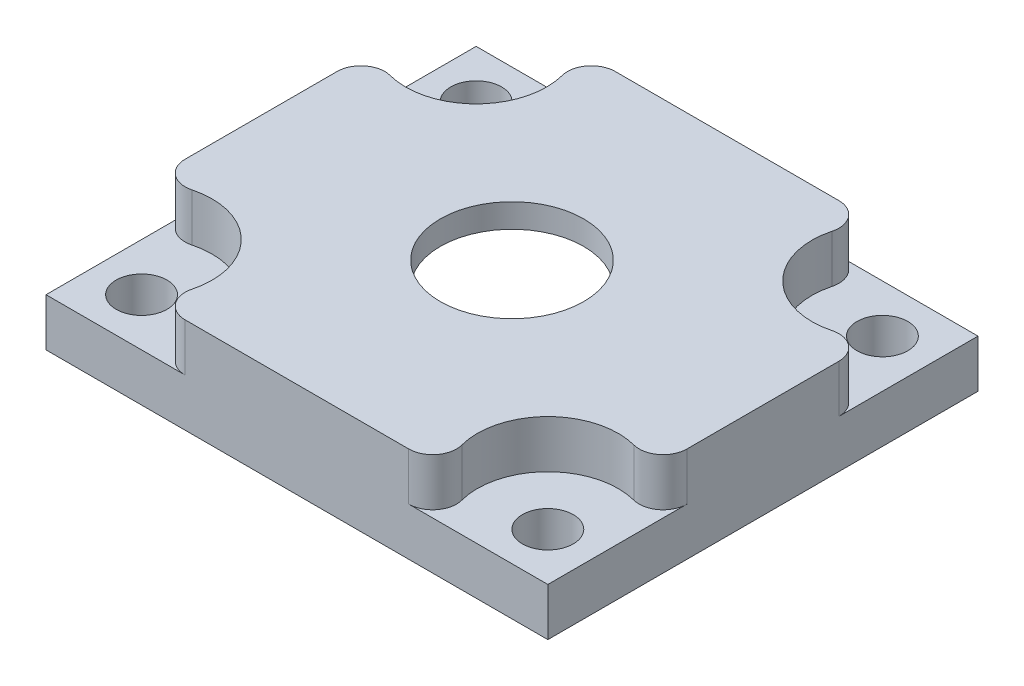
ISO-10303-21;
HEADER;
FILE_DESCRIPTION(('STEP AP214'),'2;1');
FILE_NAME('part.step','',(''),(''),'','','');
FILE_SCHEMA(('AUTOMOTIVE_DESIGN { 1 0 10303 214 1 1 1 1 }'));
ENDSEC;
DATA;
#1=APPLICATION_CONTEXT('core data for automotive mechanical design processes');
#2=APPLICATION_PROTOCOL_DEFINITION('international standard','automotive_design',2000,#1);
#3=PRODUCT_CONTEXT('',#1,'mechanical');
#4=PRODUCT('Part','Part','',(#3));
#5=PRODUCT_RELATED_PRODUCT_CATEGORY('part','',(#4));
#6=PRODUCT_DEFINITION_FORMATION('','',#4);
#7=PRODUCT_DEFINITION_CONTEXT('part definition',#1,'design');
#8=PRODUCT_DEFINITION('design','',#6,#7);
#9=PRODUCT_DEFINITION_SHAPE('','',#8);
#10=(LENGTH_UNIT() NAMED_UNIT(*) SI_UNIT(.MILLI.,.METRE.));
#11=(NAMED_UNIT(*) PLANE_ANGLE_UNIT() SI_UNIT($,.RADIAN.));
#12=(NAMED_UNIT(*) SI_UNIT($,.STERADIAN.) SOLID_ANGLE_UNIT());
#13=UNCERTAINTY_MEASURE_WITH_UNIT(LENGTH_MEASURE(1.E-05),#10,'distance_accuracy_value','');
#14=(GEOMETRIC_REPRESENTATION_CONTEXT(3) GLOBAL_UNCERTAINTY_ASSIGNED_CONTEXT((#13)) GLOBAL_UNIT_ASSIGNED_CONTEXT((#10,
#11,#12)) REPRESENTATION_CONTEXT('',''));
#15=CARTESIAN_POINT('',(0.,0.,0.));
#16=DIRECTION('',(0.,0.,1.));
#17=DIRECTION('',(1.,0.,0.));
#18=AXIS2_PLACEMENT_3D('',#15,#16,#17);
#19=CARTESIAN_POINT('',(0.,12.7,0.));
#20=DIRECTION('',(0.,-1.,0.));
#21=DIRECTION('',(0.,0.,-1.));
#22=AXIS2_PLACEMENT_3D('',#19,#20,#21);
#23=PLANE('',#22);
#24=CARTESIAN_POINT('',(0.,12.7,0.));
#25=DIRECTION('',(0.,1.,0.));
#26=DIRECTION('',(0.,0.,1.));
#27=AXIS2_PLACEMENT_3D('',#24,#25,#26);
#28=CIRCLE('',#27,9.525);
#29=CARTESIAN_POINT('',(0.,12.7,9.525));
#30=VERTEX_POINT('',#29);
#31=EDGE_CURVE('E815',#30,#30,#28,.T.);
#32=ORIENTED_EDGE('',*,*,#31,.F.);
#33=EDGE_LOOP('',(#32));
#34=FACE_BOUND('',#33,.T.);
#35=DIRECTION('',(-1.,0.,0.));
#36=VECTOR('',#35,1.);
#37=CARTESIAN_POINT('',(-33.3375,12.7,-28.575));
#38=LINE('',#37,#36);
#39=CARTESIAN_POINT('',(14.8548034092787,12.7,-28.575));
#40=VERTEX_POINT('',#39);
#41=CARTESIAN_POINT('',(-14.8548034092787,12.7,-28.575));
#42=VERTEX_POINT('',#41);
#43=EDGE_CURVE('E470',#40,#42,#38,.T.);
#44=ORIENTED_EDGE('',*,*,#43,.T.);
#45=CARTESIAN_POINT('',(-14.8548034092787,12.7,-25.4));
#46=DIRECTION('',(0.,-1.,0.));
#47=DIRECTION('',(0.,0.,-1.));
#48=AXIS2_PLACEMENT_3D('',#45,#46,#47);
#49=CIRCLE('',#48,3.175);
#50=CARTESIAN_POINT('',(-17.9263721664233,12.7,-24.5962025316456));
#51=VERTEX_POINT('',#50);
#52=EDGE_CURVE('E529',#42,#51,#49,.F.);
#53=ORIENTED_EDGE('',*,*,#52,.T.);
#54=CARTESIAN_POINT('',(-26.9875,12.7,-22.225));
#55=DIRECTION('',(0.,1.,0.));
#56=DIRECTION('',(0.,0.,1.));
#57=AXIS2_PLACEMENT_3D('',#54,#55,#56);
#58=CIRCLE('',#57,9.36625);
#59=CARTESIAN_POINT('',(-29.3587025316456,12.7,-13.1638721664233));
#60=VERTEX_POINT('',#59);
#61=EDGE_CURVE('E411',#60,#51,#58,.T.);
#62=ORIENTED_EDGE('',*,*,#61,.F.);
#63=CARTESIAN_POINT('',(-30.1625,12.7,-10.0923034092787));
#64=DIRECTION('',(0.,-1.,0.));
#65=DIRECTION('',(0.,0.,-1.));
#66=AXIS2_PLACEMENT_3D('',#63,#64,#65);
#67=CIRCLE('',#66,3.175);
#68=CARTESIAN_POINT('',(-33.3375,12.7,-10.0923034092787));
#69=VERTEX_POINT('',#68);
#70=EDGE_CURVE('E527',#60,#69,#67,.F.);
#71=ORIENTED_EDGE('',*,*,#70,.T.);
#72=DIRECTION('',(0.,0.,1.));
#73=VECTOR('',#72,1.);
#74=CARTESIAN_POINT('',(-33.3375,12.7,28.575));
#75=LINE('',#74,#73);
#76=CARTESIAN_POINT('',(-33.3375,12.7,10.0923034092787));
#77=VERTEX_POINT('',#76);
#78=EDGE_CURVE('E474',#69,#77,#75,.T.);
#79=ORIENTED_EDGE('',*,*,#78,.T.);
#80=CARTESIAN_POINT('',(-30.1625,12.7,10.0923034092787));
#81=DIRECTION('',(0.,-1.,0.));
#82=DIRECTION('',(0.,0.,-1.));
#83=AXIS2_PLACEMENT_3D('',#80,#81,#82);
#84=CIRCLE('',#83,3.175);
#85=CARTESIAN_POINT('',(-29.3587025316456,12.7,13.1638721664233));
#86=VERTEX_POINT('',#85);
#87=EDGE_CURVE('E517',#77,#86,#84,.F.);
#88=ORIENTED_EDGE('',*,*,#87,.T.);
#89=CARTESIAN_POINT('',(-26.9875,12.7,22.225));
#90=DIRECTION('',(0.,1.,0.));
#91=DIRECTION('',(0.,0.,1.));
#92=AXIS2_PLACEMENT_3D('',#89,#90,#91);
#93=CIRCLE('',#92,9.36625);
#94=CARTESIAN_POINT('',(-17.9263721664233,12.7,24.5962025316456));
#95=VERTEX_POINT('',#94);
#96=EDGE_CURVE('E440',#95,#86,#93,.T.);
#97=ORIENTED_EDGE('',*,*,#96,.F.);
#98=CARTESIAN_POINT('',(-14.8548034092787,12.7,25.4));
#99=DIRECTION('',(0.,-1.,0.));
#100=DIRECTION('',(0.,0.,-1.));
#101=AXIS2_PLACEMENT_3D('',#98,#99,#100);
#102=CIRCLE('',#101,3.175);
#103=CARTESIAN_POINT('',(-14.8548034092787,12.7,28.575));
#104=VERTEX_POINT('',#103);
#105=EDGE_CURVE('E515',#95,#104,#102,.F.);
#106=ORIENTED_EDGE('',*,*,#105,.T.);
#107=DIRECTION('',(1.,0.,0.));
#108=VECTOR('',#107,1.);
#109=CARTESIAN_POINT('',(-33.3375,12.7,28.575));
#110=LINE('',#109,#108);
#111=CARTESIAN_POINT('',(14.8548034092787,12.7,28.575));
#112=VERTEX_POINT('',#111);
#113=EDGE_CURVE('E477',#104,#112,#110,.T.);
#114=ORIENTED_EDGE('',*,*,#113,.T.);
#115=CARTESIAN_POINT('',(14.8548034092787,12.7,25.4));
#116=DIRECTION('',(0.,-1.,0.));
#117=DIRECTION('',(0.,0.,-1.));
#118=AXIS2_PLACEMENT_3D('',#115,#116,#117);
#119=CIRCLE('',#118,3.175);
#120=CARTESIAN_POINT('',(17.9263721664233,12.7,24.5962025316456));
#121=VERTEX_POINT('',#120);
#122=EDGE_CURVE('E519',#112,#121,#119,.F.);
#123=ORIENTED_EDGE('',*,*,#122,.T.);
#124=CARTESIAN_POINT('',(26.9875,12.7,22.225));
#125=DIRECTION('',(0.,1.,0.));
#126=DIRECTION('',(0.,0.,1.));
#127=AXIS2_PLACEMENT_3D('',#124,#125,#126);
#128=CIRCLE('',#127,9.36625);
#129=CARTESIAN_POINT('',(29.3587025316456,12.7,13.1638721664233));
#130=VERTEX_POINT('',#129);
#131=EDGE_CURVE('E425',#130,#121,#128,.T.);
#132=ORIENTED_EDGE('',*,*,#131,.F.);
#133=CARTESIAN_POINT('',(30.1625,12.7,10.0923034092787));
#134=DIRECTION('',(0.,-1.,0.));
#135=DIRECTION('',(0.,0.,-1.));
#136=AXIS2_PLACEMENT_3D('',#133,#134,#135);
#137=CIRCLE('',#136,3.175);
#138=CARTESIAN_POINT('',(33.3375,12.7,10.0923034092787));
#139=VERTEX_POINT('',#138);
#140=EDGE_CURVE('E521',#130,#139,#137,.F.);
#141=ORIENTED_EDGE('',*,*,#140,.T.);
#142=DIRECTION('',(0.,0.,-1.));
#143=VECTOR('',#142,1.);
#144=CARTESIAN_POINT('',(33.3375,12.7,28.575));
#145=LINE('',#144,#143);
#146=CARTESIAN_POINT('',(33.3375,12.7,-10.0923034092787));
#147=VERTEX_POINT('',#146);
#148=EDGE_CURVE('E467',#139,#147,#145,.T.);
#149=ORIENTED_EDGE('',*,*,#148,.T.);
#150=CARTESIAN_POINT('',(30.1625,12.7,-10.0923034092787));
#151=DIRECTION('',(0.,-1.,0.));
#152=DIRECTION('',(0.,0.,-1.));
#153=AXIS2_PLACEMENT_3D('',#150,#151,#152);
#154=CIRCLE('',#153,3.175);
#155=CARTESIAN_POINT('',(29.3587025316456,12.7,-13.1638721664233));
#156=VERTEX_POINT('',#155);
#157=EDGE_CURVE('E525',#147,#156,#154,.F.);
#158=ORIENTED_EDGE('',*,*,#157,.T.);
#159=CARTESIAN_POINT('',(26.9875,12.7,-22.225));
#160=DIRECTION('',(0.,1.,0.));
#161=DIRECTION('',(0.,0.,1.));
#162=AXIS2_PLACEMENT_3D('',#159,#160,#161);
#163=CIRCLE('',#162,9.36625);
#164=CARTESIAN_POINT('',(17.9263721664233,12.7,-24.5962025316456));
#165=VERTEX_POINT('',#164);
#166=EDGE_CURVE('E453',#165,#156,#163,.T.);
#167=ORIENTED_EDGE('',*,*,#166,.F.);
#168=CARTESIAN_POINT('',(14.8548034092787,12.7,-25.4));
#169=DIRECTION('',(0.,-1.,0.));
#170=DIRECTION('',(0.,0.,-1.));
#171=AXIS2_PLACEMENT_3D('',#168,#169,#170);
#172=CIRCLE('',#171,3.175);
#173=EDGE_CURVE('E523',#165,#40,#172,.F.);
#174=ORIENTED_EDGE('',*,*,#173,.T.);
#175=EDGE_LOOP('',(#44,#53,#62,#71,#79,#88,#97,#106,#114,#123,#132,#141,#149,#158,#167,#174));
#176=FACE_BOUND('',#175,.T.);
#177=ADVANCED_FACE('F43',(#34,#176),#23,.F.);
#178=CARTESIAN_POINT('',(33.3375,12.7,28.575));
#179=DIRECTION('',(-1.,0.,0.));
#180=DIRECTION('',(0.,0.,1.));
#181=AXIS2_PLACEMENT_3D('',#178,#179,#180);
#182=PLANE('',#181);
#183=DIRECTION('',(0.,0.,1.));
#184=VECTOR('',#183,1.);
#185=CARTESIAN_POINT('',(33.3375,6.35,28.575));
#186=LINE('',#185,#184);
#187=CARTESIAN_POINT('',(33.3375,6.35,-28.575));
#188=VERTEX_POINT('',#187);
#189=CARTESIAN_POINT('',(33.3375,6.35,-10.0923034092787));
#190=VERTEX_POINT('',#189);
#191=EDGE_CURVE('E456',#188,#190,#186,.T.);
#192=ORIENTED_EDGE('',*,*,#191,.T.);
#193=DIRECTION('',(0.,1.,0.));
#194=VECTOR('',#193,1.);
#195=CARTESIAN_POINT('',(33.3375,12.7,-10.0923034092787));
#196=LINE('',#195,#194);
#197=EDGE_CURVE('E544',#190,#147,#196,.T.);
#198=ORIENTED_EDGE('',*,*,#197,.T.);
#199=ORIENTED_EDGE('',*,*,#148,.F.);
#200=DIRECTION('',(0.,1.,0.));
#201=VECTOR('',#200,1.);
#202=CARTESIAN_POINT('',(33.3375,12.7,10.0923034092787));
#203=LINE('',#202,#201);
#204=CARTESIAN_POINT('',(33.3375,6.35,10.0923034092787));
#205=VERTEX_POINT('',#204);
#206=EDGE_CURVE('E541',#139,#205,#203,.F.);
#207=ORIENTED_EDGE('',*,*,#206,.T.);
#208=DIRECTION('',(0.,0.,1.));
#209=VECTOR('',#208,1.);
#210=CARTESIAN_POINT('',(33.3375,6.35,28.575));
#211=LINE('',#210,#209);
#212=CARTESIAN_POINT('',(33.3375,6.35,28.575));
#213=VERTEX_POINT('',#212);
#214=EDGE_CURVE('E437',#205,#213,#211,.T.);
#215=ORIENTED_EDGE('',*,*,#214,.T.);
#216=DIRECTION('',(0.,-1.,0.));
#217=VECTOR('',#216,1.);
#218=CARTESIAN_POINT('',(33.3375,12.7,28.575));
#219=LINE('',#218,#217);
#220=CARTESIAN_POINT('',(33.3375,0.,28.575));
#221=VERTEX_POINT('',#220);
#222=EDGE_CURVE('E480',#213,#221,#219,.T.);
#223=ORIENTED_EDGE('',*,*,#222,.T.);
#224=DIRECTION('',(0.,0.,-1.));
#225=VECTOR('',#224,1.);
#226=CARTESIAN_POINT('',(33.3375,0.,28.575));
#227=LINE('',#226,#225);
#228=CARTESIAN_POINT('',(33.3375,0.,-28.575));
#229=VERTEX_POINT('',#228);
#230=EDGE_CURVE('E466',#221,#229,#227,.T.);
#231=ORIENTED_EDGE('',*,*,#230,.T.);
#232=DIRECTION('',(0.,-1.,0.));
#233=VECTOR('',#232,1.);
#234=CARTESIAN_POINT('',(33.3375,12.7,-28.575));
#235=LINE('',#234,#233);
#236=EDGE_CURVE('E457',#188,#229,#235,.T.);
#237=ORIENTED_EDGE('',*,*,#236,.F.);
#238=EDGE_LOOP('',(#192,#198,#199,#207,#215,#223,#231,#237));
#239=FACE_BOUND('',#238,.T.);
#240=ADVANCED_FACE('F637',(#239),#182,.F.);
#241=CARTESIAN_POINT('',(-33.3375,12.7,-28.575));
#242=DIRECTION('',(0.,0.,1.));
#243=DIRECTION('',(1.,0.,0.));
#244=AXIS2_PLACEMENT_3D('',#241,#242,#243);
#245=PLANE('',#244);
#246=DIRECTION('',(1.,0.,0.));
#247=VECTOR('',#246,1.);
#248=CARTESIAN_POINT('',(-33.3375,6.35,-28.575));
#249=LINE('',#248,#247);
#250=CARTESIAN_POINT('',(-33.3375,6.35,-28.575));
#251=VERTEX_POINT('',#250);
#252=CARTESIAN_POINT('',(-14.8548034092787,6.35,-28.575));
#253=VERTEX_POINT('',#252);
#254=EDGE_CURVE('E423',#251,#253,#249,.T.);
#255=ORIENTED_EDGE('',*,*,#254,.T.);
#256=DIRECTION('',(0.,1.,0.));
#257=VECTOR('',#256,1.);
#258=CARTESIAN_POINT('',(-14.8548034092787,12.7,-28.575));
#259=LINE('',#258,#257);
#260=EDGE_CURVE('E512',#253,#42,#259,.T.);
#261=ORIENTED_EDGE('',*,*,#260,.T.);
#262=ORIENTED_EDGE('',*,*,#43,.F.);
#263=DIRECTION('',(0.,1.,0.));
#264=VECTOR('',#263,1.);
#265=CARTESIAN_POINT('',(14.8548034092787,12.7,-28.575));
#266=LINE('',#265,#264);
#267=CARTESIAN_POINT('',(14.8548034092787,6.35,-28.575));
#268=VERTEX_POINT('',#267);
#269=EDGE_CURVE('E509',#40,#268,#266,.F.);
#270=ORIENTED_EDGE('',*,*,#269,.T.);
#271=DIRECTION('',(1.,0.,0.));
#272=VECTOR('',#271,1.);
#273=CARTESIAN_POINT('',(-33.3375,6.35,-28.575));
#274=LINE('',#273,#272);
#275=EDGE_CURVE('E498',#268,#188,#274,.T.);
#276=ORIENTED_EDGE('',*,*,#275,.T.);
#277=ORIENTED_EDGE('',*,*,#236,.T.);
#278=DIRECTION('',(-1.,0.,0.));
#279=VECTOR('',#278,1.);
#280=CARTESIAN_POINT('',(-33.3375,0.,-28.575));
#281=LINE('',#280,#279);
#282=CARTESIAN_POINT('',(-33.3375,0.,-28.575));
#283=VERTEX_POINT('',#282);
#284=EDGE_CURVE('E483',#229,#283,#281,.T.);
#285=ORIENTED_EDGE('',*,*,#284,.T.);
#286=DIRECTION('',(0.,-1.,0.));
#287=VECTOR('',#286,1.);
#288=CARTESIAN_POINT('',(-33.3375,12.7,-28.575));
#289=LINE('',#288,#287);
#290=EDGE_CURVE('E494',#251,#283,#289,.T.);
#291=ORIENTED_EDGE('',*,*,#290,.F.);
#292=EDGE_LOOP('',(#255,#261,#262,#270,#276,#277,#285,#291));
#293=FACE_BOUND('',#292,.T.);
#294=ADVANCED_FACE('F602',(#293),#245,.F.);
#295=CARTESIAN_POINT('',(-33.3375,12.7,28.575));
#296=DIRECTION('',(1.,0.,0.));
#297=DIRECTION('',(0.,0.,-1.));
#298=AXIS2_PLACEMENT_3D('',#295,#296,#297);
#299=PLANE('',#298);
#300=ORIENTED_EDGE('',*,*,#78,.F.);
#301=DIRECTION('',(0.,1.,0.));
#302=VECTOR('',#301,1.);
#303=CARTESIAN_POINT('',(-33.3375,12.7,-10.0923034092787));
#304=LINE('',#303,#302);
#305=CARTESIAN_POINT('',(-33.3375,6.35,-10.0923034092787));
#306=VERTEX_POINT('',#305);
#307=EDGE_CURVE('E538',#69,#306,#304,.F.);
#308=ORIENTED_EDGE('',*,*,#307,.T.);
#309=DIRECTION('',(0.,0.,-1.));
#310=VECTOR('',#309,1.);
#311=CARTESIAN_POINT('',(-33.3375,6.35,28.575));
#312=LINE('',#311,#310);
#313=EDGE_CURVE('E506',#306,#251,#312,.T.);
#314=ORIENTED_EDGE('',*,*,#313,.T.);
#315=ORIENTED_EDGE('',*,*,#290,.T.);
#316=DIRECTION('',(0.,0.,1.));
#317=VECTOR('',#316,1.);
#318=CARTESIAN_POINT('',(-33.3375,0.,28.575));
#319=LINE('',#318,#317);
#320=CARTESIAN_POINT('',(-33.3375,0.,28.575));
#321=VERTEX_POINT('',#320);
#322=EDGE_CURVE('E486',#283,#321,#319,.T.);
#323=ORIENTED_EDGE('',*,*,#322,.T.);
#324=DIRECTION('',(0.,-1.,0.));
#325=VECTOR('',#324,1.);
#326=CARTESIAN_POINT('',(-33.3375,12.7,28.575));
#327=LINE('',#326,#325);
#328=CARTESIAN_POINT('',(-33.3375,6.35,28.575));
#329=VERTEX_POINT('',#328);
#330=EDGE_CURVE('E492',#329,#321,#327,.T.);
#331=ORIENTED_EDGE('',*,*,#330,.F.);
#332=DIRECTION('',(0.,0.,-1.));
#333=VECTOR('',#332,1.);
#334=CARTESIAN_POINT('',(-33.3375,6.35,28.575));
#335=LINE('',#334,#333);
#336=CARTESIAN_POINT('',(-33.3375,6.35,10.0923034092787));
#337=VERTEX_POINT('',#336);
#338=EDGE_CURVE('E450',#329,#337,#335,.T.);
#339=ORIENTED_EDGE('',*,*,#338,.T.);
#340=DIRECTION('',(0.,1.,0.));
#341=VECTOR('',#340,1.);
#342=CARTESIAN_POINT('',(-33.3375,12.7,10.0923034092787));
#343=LINE('',#342,#341);
#344=EDGE_CURVE('E535',#337,#77,#343,.T.);
#345=ORIENTED_EDGE('',*,*,#344,.T.);
#346=EDGE_LOOP('',(#300,#308,#314,#315,#323,#331,#339,#345));
#347=FACE_BOUND('',#346,.T.);
#348=ADVANCED_FACE('F588',(#347),#299,.F.);
#349=CARTESIAN_POINT('',(-33.3375,12.7,28.575));
#350=DIRECTION('',(0.,0.,-1.));
#351=DIRECTION('',(-1.,0.,0.));
#352=AXIS2_PLACEMENT_3D('',#349,#350,#351);
#353=PLANE('',#352);
#354=DIRECTION('',(-1.,0.,0.));
#355=VECTOR('',#354,1.);
#356=CARTESIAN_POINT('',(-33.3375,6.35,28.575));
#357=LINE('',#356,#355);
#358=CARTESIAN_POINT('',(14.8548034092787,6.35,28.575));
#359=VERTEX_POINT('',#358);
#360=EDGE_CURVE('E504',#213,#359,#357,.T.);
#361=ORIENTED_EDGE('',*,*,#360,.T.);
#362=DIRECTION('',(0.,1.,0.));
#363=VECTOR('',#362,1.);
#364=CARTESIAN_POINT('',(14.8548034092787,12.7,28.575));
#365=LINE('',#364,#363);
#366=EDGE_CURVE('E558',#359,#112,#365,.T.);
#367=ORIENTED_EDGE('',*,*,#366,.T.);
#368=ORIENTED_EDGE('',*,*,#113,.F.);
#369=DIRECTION('',(0.,1.,0.));
#370=VECTOR('',#369,1.);
#371=CARTESIAN_POINT('',(-14.8548034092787,12.7,28.575));
#372=LINE('',#371,#370);
#373=CARTESIAN_POINT('',(-14.8548034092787,6.35,28.575));
#374=VERTEX_POINT('',#373);
#375=EDGE_CURVE('E555',#104,#374,#372,.F.);
#376=ORIENTED_EDGE('',*,*,#375,.T.);
#377=DIRECTION('',(-1.,0.,0.));
#378=VECTOR('',#377,1.);
#379=CARTESIAN_POINT('',(-33.3375,6.35,28.575));
#380=LINE('',#379,#378);
#381=EDGE_CURVE('E501',#374,#329,#380,.T.);
#382=ORIENTED_EDGE('',*,*,#381,.T.);
#383=ORIENTED_EDGE('',*,*,#330,.T.);
#384=DIRECTION('',(1.,0.,0.));
#385=VECTOR('',#384,1.);
#386=CARTESIAN_POINT('',(-33.3375,0.,28.575));
#387=LINE('',#386,#385);
#388=EDGE_CURVE('E471',#321,#221,#387,.T.);
#389=ORIENTED_EDGE('',*,*,#388,.T.);
#390=ORIENTED_EDGE('',*,*,#222,.F.);
#391=EDGE_LOOP('',(#361,#367,#368,#376,#382,#383,#389,#390));
#392=FACE_BOUND('',#391,.T.);
#393=ADVANCED_FACE('F611',(#392),#353,.F.);
#394=CARTESIAN_POINT('',(0.,0.,0.));
#395=DIRECTION('',(0.,-1.,0.));
#396=DIRECTION('',(0.,0.,-1.));
#397=AXIS2_PLACEMENT_3D('',#394,#395,#396);
#398=PLANE('',#397);
#399=CARTESIAN_POINT('',(26.9875,0.,-22.225));
#400=DIRECTION('',(0.,-1.,0.));
#401=DIRECTION('',(0.,0.,-1.));
#402=AXIS2_PLACEMENT_3D('',#399,#400,#401);
#403=CIRCLE('',#402,6.5532);
#404=CARTESIAN_POINT('',(21.2548038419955,0.,-25.4));
#405=VERTEX_POINT('',#404);
#406=CARTESIAN_POINT('',(30.1625,0.,-16.4923038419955));
#407=VERTEX_POINT('',#406);
#408=EDGE_CURVE('E376',#405,#407,#403,.F.);
#409=ORIENTED_EDGE('',*,*,#408,.F.);
#410=DIRECTION('',(-1.,0.,0.));
#411=VECTOR('',#410,1.);
#412=CARTESIAN_POINT('',(0.,0.,-25.4));
#413=LINE('',#412,#411);
#414=CARTESIAN_POINT('',(-21.2548038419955,0.,-25.4));
#415=VERTEX_POINT('',#414);
#416=EDGE_CURVE('E381',#405,#415,#413,.T.);
#417=ORIENTED_EDGE('',*,*,#416,.T.);
#418=CARTESIAN_POINT('',(-26.9875,0.,-22.225));
#419=DIRECTION('',(0.,-1.,0.));
#420=DIRECTION('',(0.,0.,-1.));
#421=AXIS2_PLACEMENT_3D('',#418,#419,#420);
#422=CIRCLE('',#421,6.5532);
#423=CARTESIAN_POINT('',(-30.1625,0.,-16.4923038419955));
#424=VERTEX_POINT('',#423);
#425=EDGE_CURVE('E329',#424,#415,#422,.F.);
#426=ORIENTED_EDGE('',*,*,#425,.F.);
#427=DIRECTION('',(0.,0.,1.));
#428=VECTOR('',#427,1.);
#429=CARTESIAN_POINT('',(-30.1625,0.,0.));
#430=LINE('',#429,#428);
#431=CARTESIAN_POINT('',(-30.1625,0.,16.4923038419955));
#432=VERTEX_POINT('',#431);
#433=EDGE_CURVE('E59',#424,#432,#430,.T.);
#434=ORIENTED_EDGE('',*,*,#433,.T.);
#435=CARTESIAN_POINT('',(-26.9875,0.,22.225));
#436=DIRECTION('',(0.,-1.,0.));
#437=DIRECTION('',(0.,0.,-1.));
#438=AXIS2_PLACEMENT_3D('',#435,#436,#437);
#439=CIRCLE('',#438,6.5532);
#440=CARTESIAN_POINT('',(-21.2548038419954,0.,25.4));
#441=VERTEX_POINT('',#440);
#442=EDGE_CURVE('E343',#441,#432,#439,.F.);
#443=ORIENTED_EDGE('',*,*,#442,.F.);
#444=DIRECTION('',(1.,0.,0.));
#445=VECTOR('',#444,1.);
#446=CARTESIAN_POINT('',(0.,0.,25.4));
#447=LINE('',#446,#445);
#448=CARTESIAN_POINT('',(21.2548038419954,0.,25.4));
#449=VERTEX_POINT('',#448);
#450=EDGE_CURVE('E382',#441,#449,#447,.T.);
#451=ORIENTED_EDGE('',*,*,#450,.T.);
#452=CARTESIAN_POINT('',(26.9875,0.,22.225));
#453=DIRECTION('',(0.,-1.,0.));
#454=DIRECTION('',(0.,0.,-1.));
#455=AXIS2_PLACEMENT_3D('',#452,#453,#454);
#456=CIRCLE('',#455,6.5532);
#457=CARTESIAN_POINT('',(30.1625,0.,16.4923038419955));
#458=VERTEX_POINT('',#457);
#459=EDGE_CURVE('E325',#458,#449,#456,.F.);
#460=ORIENTED_EDGE('',*,*,#459,.F.);
#461=DIRECTION('',(0.,0.,-1.));
#462=VECTOR('',#461,1.);
#463=CARTESIAN_POINT('',(30.1625,0.,0.));
#464=LINE('',#463,#462);
#465=EDGE_CURVE('E378',#458,#407,#464,.T.);
#466=ORIENTED_EDGE('',*,*,#465,.T.);
#467=EDGE_LOOP('',(#409,#417,#426,#434,#443,#451,#460,#466));
#468=FACE_BOUND('',#467,.T.);
#469=CARTESIAN_POINT('',(-26.9875,0.,-22.225));
#470=DIRECTION('',(0.,1.,0.));
#471=DIRECTION('',(0.,0.,1.));
#472=AXIS2_PLACEMENT_3D('',#469,#470,#471);
#473=CIRCLE('',#472,3.3782);
#474=CARTESIAN_POINT('',(-26.9875,0.,-18.8468));
#475=VERTEX_POINT('',#474);
#476=EDGE_CURVE('E420',#475,#475,#473,.T.);
#477=ORIENTED_EDGE('',*,*,#476,.T.);
#478=EDGE_LOOP('',(#477));
#479=FACE_BOUND('',#478,.T.);
#480=CARTESIAN_POINT('',(26.9875,0.,22.225));
#481=DIRECTION('',(0.,1.,0.));
#482=DIRECTION('',(0.,0.,1.));
#483=AXIS2_PLACEMENT_3D('',#480,#481,#482);
#484=CIRCLE('',#483,3.3782);
#485=CARTESIAN_POINT('',(26.9875,0.,25.6032));
#486=VERTEX_POINT('',#485);
#487=EDGE_CURVE('E434',#486,#486,#484,.T.);
#488=ORIENTED_EDGE('',*,*,#487,.T.);
#489=EDGE_LOOP('',(#488));
#490=FACE_BOUND('',#489,.T.);
#491=CARTESIAN_POINT('',(-26.9875,0.,22.225));
#492=DIRECTION('',(0.,1.,0.));
#493=DIRECTION('',(0.,0.,1.));
#494=AXIS2_PLACEMENT_3D('',#491,#492,#493);
#495=CIRCLE('',#494,3.3782);
#496=CARTESIAN_POINT('',(-26.9875,0.,25.6032));
#497=VERTEX_POINT('',#496);
#498=EDGE_CURVE('E447',#497,#497,#495,.T.);
#499=ORIENTED_EDGE('',*,*,#498,.T.);
#500=EDGE_LOOP('',(#499));
#501=FACE_BOUND('',#500,.T.);
#502=CARTESIAN_POINT('',(26.9875,0.,-22.225));
#503=DIRECTION('',(0.,1.,0.));
#504=DIRECTION('',(0.,0.,1.));
#505=AXIS2_PLACEMENT_3D('',#502,#503,#504);
#506=CIRCLE('',#505,3.3782);
#507=CARTESIAN_POINT('',(26.9875,0.,-18.8468));
#508=VERTEX_POINT('',#507);
#509=EDGE_CURVE('E463',#508,#508,#506,.T.);
#510=ORIENTED_EDGE('',*,*,#509,.T.);
#511=EDGE_LOOP('',(#510));
#512=FACE_BOUND('',#511,.T.);
#513=ORIENTED_EDGE('',*,*,#230,.F.);
#514=ORIENTED_EDGE('',*,*,#388,.F.);
#515=ORIENTED_EDGE('',*,*,#322,.F.);
#516=ORIENTED_EDGE('',*,*,#284,.F.);
#517=EDGE_LOOP('',(#513,#514,#515,#516));
#518=FACE_BOUND('',#517,.T.);
#519=ADVANCED_FACE('F609',(#468,#479,#490,#501,#512,#518),#398,.T.);
#520=CARTESIAN_POINT('',(30.3657,6.35,-22.225));
#521=DIRECTION('',(0.,-1.,0.));
#522=DIRECTION('',(0.,0.,-1.));
#523=AXIS2_PLACEMENT_3D('',#520,#521,#522);
#524=PLANE('',#523);
#525=CARTESIAN_POINT('',(26.9875,6.35,-22.225));
#526=DIRECTION('',(0.,1.,0.));
#527=DIRECTION('',(0.,0.,1.));
#528=AXIS2_PLACEMENT_3D('',#525,#526,#527);
#529=CIRCLE('',#528,3.3782);
#530=CARTESIAN_POINT('',(26.9875,6.35,-18.8468));
#531=VERTEX_POINT('',#530);
#532=EDGE_CURVE('E460',#531,#531,#529,.T.);
#533=ORIENTED_EDGE('',*,*,#532,.F.);
#534=EDGE_LOOP('',(#533));
#535=FACE_BOUND('',#534,.T.);
#536=ORIENTED_EDGE('',*,*,#275,.F.);
#537=CARTESIAN_POINT('',(14.8548034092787,6.35,-25.4));
#538=DIRECTION('',(0.,-1.,0.));
#539=DIRECTION('',(0.,0.,-1.));
#540=AXIS2_PLACEMENT_3D('',#537,#538,#539);
#541=CIRCLE('',#540,3.175);
#542=CARTESIAN_POINT('',(17.9263721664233,6.35,-24.5962025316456));
#543=VERTEX_POINT('',#542);
#544=EDGE_CURVE('E572',#268,#543,#541,.T.);
#545=ORIENTED_EDGE('',*,*,#544,.T.);
#546=CARTESIAN_POINT('',(26.9875,6.35,-22.225));
#547=DIRECTION('',(0.,1.,0.));
#548=DIRECTION('',(0.,0.,1.));
#549=AXIS2_PLACEMENT_3D('',#546,#547,#548);
#550=CIRCLE('',#549,9.36625);
#551=CARTESIAN_POINT('',(29.3587025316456,6.35,-13.1638721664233));
#552=VERTEX_POINT('',#551);
#553=EDGE_CURVE('E452',#543,#552,#550,.T.);
#554=ORIENTED_EDGE('',*,*,#553,.T.);
#555=CARTESIAN_POINT('',(30.1625,6.35,-10.0923034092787));
#556=DIRECTION('',(0.,-1.,0.));
#557=DIRECTION('',(0.,0.,-1.));
#558=AXIS2_PLACEMENT_3D('',#555,#556,#557);
#559=CIRCLE('',#558,3.175);
#560=EDGE_CURVE('E569',#552,#190,#559,.T.);
#561=ORIENTED_EDGE('',*,*,#560,.T.);
#562=ORIENTED_EDGE('',*,*,#191,.F.);
#563=EDGE_LOOP('',(#536,#545,#554,#561,#562));
#564=FACE_BOUND('',#563,.T.);
#565=ADVANCED_FACE('F694',(#535,#564),#524,.F.);
#566=CARTESIAN_POINT('',(26.9875,12.7,-22.225));
#567=DIRECTION('',(0.,1.,0.));
#568=DIRECTION('',(0.,0.,1.));
#569=AXIS2_PLACEMENT_3D('',#566,#567,#568);
#570=CYLINDRICAL_SURFACE('',#569,9.36625);
#571=ORIENTED_EDGE('',*,*,#166,.T.);
#572=DIRECTION('',(0.,1.,0.));
#573=VECTOR('',#572,1.);
#574=CARTESIAN_POINT('',(29.3587025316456,12.7,-13.1638721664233));
#575=LINE('',#574,#573);
#576=EDGE_CURVE('E549',#156,#552,#575,.F.);
#577=ORIENTED_EDGE('',*,*,#576,.T.);
#578=ORIENTED_EDGE('',*,*,#553,.F.);
#579=DIRECTION('',(0.,1.,0.));
#580=VECTOR('',#579,1.);
#581=CARTESIAN_POINT('',(17.9263721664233,12.7,-24.5962025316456));
#582=LINE('',#581,#580);
#583=EDGE_CURVE('E547',#543,#165,#582,.T.);
#584=ORIENTED_EDGE('',*,*,#583,.T.);
#585=EDGE_LOOP('',(#571,#577,#578,#584));
#586=FACE_BOUND('',#585,.T.);
#587=ADVANCED_FACE('F646',(#586),#570,.F.);
#588=CARTESIAN_POINT('',(26.9875,12.7,-22.225));
#589=DIRECTION('',(0.,1.,0.));
#590=DIRECTION('',(0.,0.,1.));
#591=AXIS2_PLACEMENT_3D('',#588,#589,#590);
#592=CYLINDRICAL_SURFACE('',#591,3.3782);
#593=ORIENTED_EDGE('',*,*,#509,.F.);
#594=EDGE_LOOP('',(#593));
#595=FACE_BOUND('',#594,.T.);
#596=ORIENTED_EDGE('',*,*,#532,.T.);
#597=EDGE_LOOP('',(#596));
#598=FACE_BOUND('',#597,.T.);
#599=ADVANCED_FACE('F690',(#595,#598),#592,.F.);
#600=CARTESIAN_POINT('',(-23.6093,6.35,22.225));
#601=DIRECTION('',(0.,-1.,0.));
#602=DIRECTION('',(0.,0.,-1.));
#603=AXIS2_PLACEMENT_3D('',#600,#601,#602);
#604=PLANE('',#603);
#605=CARTESIAN_POINT('',(-26.9875,6.35,22.225));
#606=DIRECTION('',(0.,1.,0.));
#607=DIRECTION('',(0.,0.,1.));
#608=AXIS2_PLACEMENT_3D('',#605,#606,#607);
#609=CIRCLE('',#608,3.3782);
#610=CARTESIAN_POINT('',(-26.9875,6.35,25.6032));
#611=VERTEX_POINT('',#610);
#612=EDGE_CURVE('E444',#611,#611,#609,.T.);
#613=ORIENTED_EDGE('',*,*,#612,.F.);
#614=EDGE_LOOP('',(#613));
#615=FACE_BOUND('',#614,.T.);
#616=ORIENTED_EDGE('',*,*,#381,.F.);
#617=CARTESIAN_POINT('',(-14.8548034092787,6.35,25.4));
#618=DIRECTION('',(0.,-1.,0.));
#619=DIRECTION('',(0.,0.,-1.));
#620=AXIS2_PLACEMENT_3D('',#617,#618,#619);
#621=CIRCLE('',#620,3.175);
#622=CARTESIAN_POINT('',(-17.9263721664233,6.35,24.5962025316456));
#623=VERTEX_POINT('',#622);
#624=EDGE_CURVE('E11',#374,#623,#621,.T.);
#625=ORIENTED_EDGE('',*,*,#624,.T.);
#626=CARTESIAN_POINT('',(-26.9875,6.35,22.225));
#627=DIRECTION('',(0.,1.,0.));
#628=DIRECTION('',(0.,0.,1.));
#629=AXIS2_PLACEMENT_3D('',#626,#627,#628);
#630=CIRCLE('',#629,9.36625);
#631=CARTESIAN_POINT('',(-29.3587025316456,6.35,13.1638721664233));
#632=VERTEX_POINT('',#631);
#633=EDGE_CURVE('E442',#623,#632,#630,.T.);
#634=ORIENTED_EDGE('',*,*,#633,.T.);
#635=CARTESIAN_POINT('',(-30.1625,6.35,10.0923034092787));
#636=DIRECTION('',(0.,-1.,0.));
#637=DIRECTION('',(0.,0.,-1.));
#638=AXIS2_PLACEMENT_3D('',#635,#636,#637);
#639=CIRCLE('',#638,3.175);
#640=EDGE_CURVE('E52',#632,#337,#639,.T.);
#641=ORIENTED_EDGE('',*,*,#640,.T.);
#642=ORIENTED_EDGE('',*,*,#338,.F.);
#643=EDGE_LOOP('',(#616,#625,#634,#641,#642));
#644=FACE_BOUND('',#643,.T.);
#645=ADVANCED_FACE('F583',(#615,#644),#604,.F.);
#646=CARTESIAN_POINT('',(-26.9875,12.7,22.225));
#647=DIRECTION('',(0.,1.,0.));
#648=DIRECTION('',(0.,0.,1.));
#649=AXIS2_PLACEMENT_3D('',#646,#647,#648);
#650=CYLINDRICAL_SURFACE('',#649,9.36625);
#651=ORIENTED_EDGE('',*,*,#96,.T.);
#652=DIRECTION('',(0.,1.,0.));
#653=VECTOR('',#652,1.);
#654=CARTESIAN_POINT('',(-29.3587025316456,12.7,13.1638721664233));
#655=LINE('',#654,#653);
#656=EDGE_CURVE('E67',#86,#632,#655,.F.);
#657=ORIENTED_EDGE('',*,*,#656,.T.);
#658=ORIENTED_EDGE('',*,*,#633,.F.);
#659=DIRECTION('',(0.,1.,0.));
#660=VECTOR('',#659,1.);
#661=CARTESIAN_POINT('',(-17.9263721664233,12.7,24.5962025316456));
#662=LINE('',#661,#660);
#663=EDGE_CURVE('E561',#623,#95,#662,.T.);
#664=ORIENTED_EDGE('',*,*,#663,.T.);
#665=EDGE_LOOP('',(#651,#657,#658,#664));
#666=FACE_BOUND('',#665,.T.);
#667=ADVANCED_FACE('F619',(#666),#650,.F.);
#668=CARTESIAN_POINT('',(-26.9875,12.7,22.225));
#669=DIRECTION('',(0.,1.,0.));
#670=DIRECTION('',(0.,0.,1.));
#671=AXIS2_PLACEMENT_3D('',#668,#669,#670);
#672=CYLINDRICAL_SURFACE('',#671,3.3782);
#673=ORIENTED_EDGE('',*,*,#498,.F.);
#674=EDGE_LOOP('',(#673));
#675=FACE_BOUND('',#674,.T.);
#676=ORIENTED_EDGE('',*,*,#612,.T.);
#677=EDGE_LOOP('',(#676));
#678=FACE_BOUND('',#677,.T.);
#679=ADVANCED_FACE('F839',(#675,#678),#672,.F.);
#680=CARTESIAN_POINT('',(30.3657,6.35,22.225));
#681=DIRECTION('',(0.,-1.,0.));
#682=DIRECTION('',(0.,0.,-1.));
#683=AXIS2_PLACEMENT_3D('',#680,#681,#682);
#684=PLANE('',#683);
#685=CARTESIAN_POINT('',(26.9875,6.35,22.225));
#686=DIRECTION('',(0.,1.,0.));
#687=DIRECTION('',(0.,0.,1.));
#688=AXIS2_PLACEMENT_3D('',#685,#686,#687);
#689=CIRCLE('',#688,3.3782);
#690=CARTESIAN_POINT('',(26.9875,6.35,25.6032));
#691=VERTEX_POINT('',#690);
#692=EDGE_CURVE('E431',#691,#691,#689,.T.);
#693=ORIENTED_EDGE('',*,*,#692,.F.);
#694=EDGE_LOOP('',(#693));
#695=FACE_BOUND('',#694,.T.);
#696=ORIENTED_EDGE('',*,*,#214,.F.);
#697=CARTESIAN_POINT('',(30.1625,6.35,10.0923034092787));
#698=DIRECTION('',(0.,-1.,0.));
#699=DIRECTION('',(0.,0.,-1.));
#700=AXIS2_PLACEMENT_3D('',#697,#698,#699);
#701=CIRCLE('',#700,3.175);
#702=CARTESIAN_POINT('',(29.3587025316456,6.35,13.1638721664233));
#703=VERTEX_POINT('',#702);
#704=EDGE_CURVE('E574',#205,#703,#701,.T.);
#705=ORIENTED_EDGE('',*,*,#704,.T.);
#706=CARTESIAN_POINT('',(26.9875,6.35,22.225));
#707=DIRECTION('',(0.,1.,0.));
#708=DIRECTION('',(0.,0.,1.));
#709=AXIS2_PLACEMENT_3D('',#706,#707,#708);
#710=CIRCLE('',#709,9.36625);
#711=CARTESIAN_POINT('',(17.9263721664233,6.35,24.5962025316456));
#712=VERTEX_POINT('',#711);
#713=EDGE_CURVE('E428',#703,#712,#710,.T.);
#714=ORIENTED_EDGE('',*,*,#713,.T.);
#715=CARTESIAN_POINT('',(14.8548034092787,6.35,25.4));
#716=DIRECTION('',(0.,-1.,0.));
#717=DIRECTION('',(0.,0.,-1.));
#718=AXIS2_PLACEMENT_3D('',#715,#716,#717);
#719=CIRCLE('',#718,3.175);
#720=EDGE_CURVE('E576',#712,#359,#719,.T.);
#721=ORIENTED_EDGE('',*,*,#720,.T.);
#722=ORIENTED_EDGE('',*,*,#360,.F.);
#723=EDGE_LOOP('',(#696,#705,#714,#721,#722));
#724=FACE_BOUND('',#723,.T.);
#725=ADVANCED_FACE('F837',(#695,#724),#684,.F.);
#726=CARTESIAN_POINT('',(26.9875,12.7,22.225));
#727=DIRECTION('',(0.,1.,0.));
#728=DIRECTION('',(0.,0.,1.));
#729=AXIS2_PLACEMENT_3D('',#726,#727,#728);
#730=CYLINDRICAL_SURFACE('',#729,9.36625);
#731=ORIENTED_EDGE('',*,*,#713,.F.);
#732=DIRECTION('',(0.,1.,0.));
#733=VECTOR('',#732,1.);
#734=CARTESIAN_POINT('',(29.3587025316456,12.7,13.1638721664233));
#735=LINE('',#734,#733);
#736=EDGE_CURVE('E553',#703,#130,#735,.T.);
#737=ORIENTED_EDGE('',*,*,#736,.T.);
#738=ORIENTED_EDGE('',*,*,#131,.T.);
#739=DIRECTION('',(0.,1.,0.));
#740=VECTOR('',#739,1.);
#741=CARTESIAN_POINT('',(17.9263721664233,12.7,24.5962025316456));
#742=LINE('',#741,#740);
#743=EDGE_CURVE('E551',#121,#712,#742,.F.);
#744=ORIENTED_EDGE('',*,*,#743,.T.);
#745=EDGE_LOOP('',(#731,#737,#738,#744));
#746=FACE_BOUND('',#745,.T.);
#747=ADVANCED_FACE('F629',(#746),#730,.F.);
#748=CARTESIAN_POINT('',(26.9875,12.7,22.225));
#749=DIRECTION('',(0.,1.,0.));
#750=DIRECTION('',(0.,0.,1.));
#751=AXIS2_PLACEMENT_3D('',#748,#749,#750);
#752=CYLINDRICAL_SURFACE('',#751,3.3782);
#753=ORIENTED_EDGE('',*,*,#487,.F.);
#754=EDGE_LOOP('',(#753));
#755=FACE_BOUND('',#754,.T.);
#756=ORIENTED_EDGE('',*,*,#692,.T.);
#757=EDGE_LOOP('',(#756));
#758=FACE_BOUND('',#757,.T.);
#759=ADVANCED_FACE('F664',(#755,#758),#752,.F.);
#760=CARTESIAN_POINT('',(-23.6093,6.35,-22.225));
#761=DIRECTION('',(0.,-1.,0.));
#762=DIRECTION('',(0.,0.,-1.));
#763=AXIS2_PLACEMENT_3D('',#760,#761,#762);
#764=PLANE('',#763);
#765=CARTESIAN_POINT('',(-26.9875,6.35,-22.225));
#766=DIRECTION('',(0.,1.,0.));
#767=DIRECTION('',(0.,0.,1.));
#768=AXIS2_PLACEMENT_3D('',#765,#766,#767);
#769=CIRCLE('',#768,3.3782);
#770=CARTESIAN_POINT('',(-26.9875,6.35,-18.8468));
#771=VERTEX_POINT('',#770);
#772=EDGE_CURVE('E417',#771,#771,#769,.T.);
#773=ORIENTED_EDGE('',*,*,#772,.F.);
#774=EDGE_LOOP('',(#773));
#775=FACE_BOUND('',#774,.T.);
#776=ORIENTED_EDGE('',*,*,#313,.F.);
#777=CARTESIAN_POINT('',(-30.1625,6.35,-10.0923034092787));
#778=DIRECTION('',(0.,-1.,0.));
#779=DIRECTION('',(0.,0.,-1.));
#780=AXIS2_PLACEMENT_3D('',#777,#778,#779);
#781=CIRCLE('',#780,3.175);
#782=CARTESIAN_POINT('',(-29.3587025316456,6.35,-13.1638721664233));
#783=VERTEX_POINT('',#782);
#784=EDGE_CURVE('E567',#306,#783,#781,.T.);
#785=ORIENTED_EDGE('',*,*,#784,.T.);
#786=CARTESIAN_POINT('',(-26.9875,6.35,-22.225));
#787=DIRECTION('',(0.,1.,0.));
#788=DIRECTION('',(0.,0.,1.));
#789=AXIS2_PLACEMENT_3D('',#786,#787,#788);
#790=CIRCLE('',#789,9.36625);
#791=CARTESIAN_POINT('',(-17.9263721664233,6.35,-24.5962025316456));
#792=VERTEX_POINT('',#791);
#793=EDGE_CURVE('E414',#783,#792,#790,.T.);
#794=ORIENTED_EDGE('',*,*,#793,.T.);
#795=CARTESIAN_POINT('',(-14.8548034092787,6.35,-25.4));
#796=DIRECTION('',(0.,-1.,0.));
#797=DIRECTION('',(0.,0.,-1.));
#798=AXIS2_PLACEMENT_3D('',#795,#796,#797);
#799=CIRCLE('',#798,3.175);
#800=EDGE_CURVE('E564',#792,#253,#799,.T.);
#801=ORIENTED_EDGE('',*,*,#800,.T.);
#802=ORIENTED_EDGE('',*,*,#254,.F.);
#803=EDGE_LOOP('',(#776,#785,#794,#801,#802));
#804=FACE_BOUND('',#803,.T.);
#805=ADVANCED_FACE('F662',(#775,#804),#764,.F.);
#806=CARTESIAN_POINT('',(-26.9875,12.7,-22.225));
#807=DIRECTION('',(0.,1.,0.));
#808=DIRECTION('',(0.,0.,1.));
#809=AXIS2_PLACEMENT_3D('',#806,#807,#808);
#810=CYLINDRICAL_SURFACE('',#809,9.36625);
#811=ORIENTED_EDGE('',*,*,#61,.T.);
#812=DIRECTION('',(0.,1.,0.));
#813=VECTOR('',#812,1.);
#814=CARTESIAN_POINT('',(-17.9263721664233,12.7,-24.5962025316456));
#815=LINE('',#814,#813);
#816=EDGE_CURVE('E533',#51,#792,#815,.F.);
#817=ORIENTED_EDGE('',*,*,#816,.T.);
#818=ORIENTED_EDGE('',*,*,#793,.F.);
#819=DIRECTION('',(0.,1.,0.));
#820=VECTOR('',#819,1.);
#821=CARTESIAN_POINT('',(-29.3587025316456,12.7,-13.1638721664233));
#822=LINE('',#821,#820);
#823=EDGE_CURVE('E531',#783,#60,#822,.T.);
#824=ORIENTED_EDGE('',*,*,#823,.T.);
#825=EDGE_LOOP('',(#811,#817,#818,#824));
#826=FACE_BOUND('',#825,.T.);
#827=ADVANCED_FACE('F660',(#826),#810,.F.);
#828=CARTESIAN_POINT('',(-26.9875,12.7,-22.225));
#829=DIRECTION('',(0.,1.,0.));
#830=DIRECTION('',(0.,0.,1.));
#831=AXIS2_PLACEMENT_3D('',#828,#829,#830);
#832=CYLINDRICAL_SURFACE('',#831,3.3782);
#833=ORIENTED_EDGE('',*,*,#476,.F.);
#834=EDGE_LOOP('',(#833));
#835=FACE_BOUND('',#834,.T.);
#836=ORIENTED_EDGE('',*,*,#772,.T.);
#837=EDGE_LOOP('',(#836));
#838=FACE_BOUND('',#837,.T.);
#839=ADVANCED_FACE('F671',(#835,#838),#832,.F.);
#840=CARTESIAN_POINT('',(-14.8548034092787,12.7,-25.4));
#841=DIRECTION('',(0.,1.,0.));
#842=DIRECTION('',(0.,0.,1.));
#843=AXIS2_PLACEMENT_3D('',#840,#841,#842);
#844=CYLINDRICAL_SURFACE('',#843,3.175);
#845=ORIENTED_EDGE('',*,*,#800,.F.);
#846=ORIENTED_EDGE('',*,*,#816,.F.);
#847=ORIENTED_EDGE('',*,*,#52,.F.);
#848=ORIENTED_EDGE('',*,*,#260,.F.);
#849=EDGE_LOOP('',(#845,#846,#847,#848));
#850=FACE_BOUND('',#849,.T.);
#851=ADVANCED_FACE('F657',(#850),#844,.T.);
#852=CARTESIAN_POINT('',(-30.1625,12.7,-10.0923034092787));
#853=DIRECTION('',(0.,1.,0.));
#854=DIRECTION('',(0.,0.,1.));
#855=AXIS2_PLACEMENT_3D('',#852,#853,#854);
#856=CYLINDRICAL_SURFACE('',#855,3.175);
#857=ORIENTED_EDGE('',*,*,#70,.F.);
#858=ORIENTED_EDGE('',*,*,#823,.F.);
#859=ORIENTED_EDGE('',*,*,#784,.F.);
#860=ORIENTED_EDGE('',*,*,#307,.F.);
#861=EDGE_LOOP('',(#857,#858,#859,#860));
#862=FACE_BOUND('',#861,.T.);
#863=ADVANCED_FACE('F597',(#862),#856,.T.);
#864=CARTESIAN_POINT('',(30.1625,12.7,-10.0923034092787));
#865=DIRECTION('',(0.,1.,0.));
#866=DIRECTION('',(0.,0.,1.));
#867=AXIS2_PLACEMENT_3D('',#864,#865,#866);
#868=CYLINDRICAL_SURFACE('',#867,3.175);
#869=ORIENTED_EDGE('',*,*,#560,.F.);
#870=ORIENTED_EDGE('',*,*,#576,.F.);
#871=ORIENTED_EDGE('',*,*,#157,.F.);
#872=ORIENTED_EDGE('',*,*,#197,.F.);
#873=EDGE_LOOP('',(#869,#870,#871,#872));
#874=FACE_BOUND('',#873,.T.);
#875=ADVANCED_FACE('F641',(#874),#868,.T.);
#876=CARTESIAN_POINT('',(14.8548034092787,12.7,-25.4));
#877=DIRECTION('',(0.,1.,0.));
#878=DIRECTION('',(0.,0.,1.));
#879=AXIS2_PLACEMENT_3D('',#876,#877,#878);
#880=CYLINDRICAL_SURFACE('',#879,3.175);
#881=ORIENTED_EDGE('',*,*,#173,.F.);
#882=ORIENTED_EDGE('',*,*,#583,.F.);
#883=ORIENTED_EDGE('',*,*,#544,.F.);
#884=ORIENTED_EDGE('',*,*,#269,.F.);
#885=EDGE_LOOP('',(#881,#882,#883,#884));
#886=FACE_BOUND('',#885,.T.);
#887=ADVANCED_FACE('F651',(#886),#880,.T.);
#888=CARTESIAN_POINT('',(30.1625,12.7,10.0923034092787));
#889=DIRECTION('',(0.,1.,0.));
#890=DIRECTION('',(0.,0.,1.));
#891=AXIS2_PLACEMENT_3D('',#888,#889,#890);
#892=CYLINDRICAL_SURFACE('',#891,3.175);
#893=ORIENTED_EDGE('',*,*,#140,.F.);
#894=ORIENTED_EDGE('',*,*,#736,.F.);
#895=ORIENTED_EDGE('',*,*,#704,.F.);
#896=ORIENTED_EDGE('',*,*,#206,.F.);
#897=EDGE_LOOP('',(#893,#894,#895,#896));
#898=FACE_BOUND('',#897,.T.);
#899=ADVANCED_FACE('F633',(#898),#892,.T.);
#900=CARTESIAN_POINT('',(14.8548034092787,12.7,25.4));
#901=DIRECTION('',(0.,1.,0.));
#902=DIRECTION('',(0.,0.,1.));
#903=AXIS2_PLACEMENT_3D('',#900,#901,#902);
#904=CYLINDRICAL_SURFACE('',#903,3.175);
#905=ORIENTED_EDGE('',*,*,#720,.F.);
#906=ORIENTED_EDGE('',*,*,#743,.F.);
#907=ORIENTED_EDGE('',*,*,#122,.F.);
#908=ORIENTED_EDGE('',*,*,#366,.F.);
#909=EDGE_LOOP('',(#905,#906,#907,#908));
#910=FACE_BOUND('',#909,.T.);
#911=ADVANCED_FACE('F623',(#910),#904,.T.);
#912=CARTESIAN_POINT('',(-30.1625,12.7,10.0923034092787));
#913=DIRECTION('',(0.,1.,0.));
#914=DIRECTION('',(0.,0.,1.));
#915=AXIS2_PLACEMENT_3D('',#912,#913,#914);
#916=CYLINDRICAL_SURFACE('',#915,3.175);
#917=ORIENTED_EDGE('',*,*,#640,.F.);
#918=ORIENTED_EDGE('',*,*,#656,.F.);
#919=ORIENTED_EDGE('',*,*,#87,.F.);
#920=ORIENTED_EDGE('',*,*,#344,.F.);
#921=EDGE_LOOP('',(#917,#918,#919,#920));
#922=FACE_BOUND('',#921,.T.);
#923=ADVANCED_FACE('F585',(#922),#916,.T.);
#924=CARTESIAN_POINT('',(-14.8548034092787,12.7,25.4));
#925=DIRECTION('',(0.,1.,0.));
#926=DIRECTION('',(0.,0.,1.));
#927=AXIS2_PLACEMENT_3D('',#924,#925,#926);
#928=CYLINDRICAL_SURFACE('',#927,3.175);
#929=ORIENTED_EDGE('',*,*,#105,.F.);
#930=ORIENTED_EDGE('',*,*,#663,.F.);
#931=ORIENTED_EDGE('',*,*,#624,.F.);
#932=ORIENTED_EDGE('',*,*,#375,.F.);
#933=EDGE_LOOP('',(#929,#930,#931,#932));
#934=FACE_BOUND('',#933,.T.);
#935=ADVANCED_FACE('F45',(#934),#928,.T.);
#936=CARTESIAN_POINT('',(0.,9.525,0.));
#937=DIRECTION('',(0.,-1.,0.));
#938=DIRECTION('',(0.,0.,-1.));
#939=AXIS2_PLACEMENT_3D('',#936,#937,#938);
#940=PLANE('',#939);
#941=CARTESIAN_POINT('',(0.,9.525,0.));
#942=DIRECTION('',(0.,-1.,0.));
#943=DIRECTION('',(0.,0.,-1.));
#944=AXIS2_PLACEMENT_3D('',#941,#942,#943);
#945=CIRCLE('',#944,9.525);
#946=CARTESIAN_POINT('',(0.,9.525,-9.525));
#947=VERTEX_POINT('',#946);
#948=EDGE_CURVE('E47',#947,#947,#945,.T.);
#949=ORIENTED_EDGE('',*,*,#948,.F.);
#950=EDGE_LOOP('',(#949));
#951=FACE_BOUND('',#950,.T.);
#952=DIRECTION('',(-1.,0.,0.));
#953=VECTOR('',#952,1.);
#954=CARTESIAN_POINT('',(0.,9.525,-25.4));
#955=LINE('',#954,#953);
#956=CARTESIAN_POINT('',(14.8548034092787,9.525,-25.4));
#957=VERTEX_POINT('',#956);
#958=CARTESIAN_POINT('',(-14.8548034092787,9.525,-25.4));
#959=VERTEX_POINT('',#958);
#960=EDGE_CURVE('E277',#957,#959,#955,.T.);
#961=ORIENTED_EDGE('',*,*,#960,.F.);
#962=CARTESIAN_POINT('',(26.9875,9.525,-22.225));
#963=DIRECTION('',(0.,-1.,0.));
#964=DIRECTION('',(0.,0.,-1.));
#965=AXIS2_PLACEMENT_3D('',#962,#963,#964);
#966=CIRCLE('',#965,12.54125);
#967=CARTESIAN_POINT('',(30.1625,9.525,-10.0923034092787));
#968=VERTEX_POINT('',#967);
#969=EDGE_CURVE('E281',#957,#968,#966,.F.);
#970=ORIENTED_EDGE('',*,*,#969,.T.);
#971=DIRECTION('',(0.,0.,-1.));
#972=VECTOR('',#971,1.);
#973=CARTESIAN_POINT('',(30.1625,9.525,0.));
#974=LINE('',#973,#972);
#975=CARTESIAN_POINT('',(30.1625,9.525,10.0923034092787));
#976=VERTEX_POINT('',#975);
#977=EDGE_CURVE('E289',#976,#968,#974,.T.);
#978=ORIENTED_EDGE('',*,*,#977,.F.);
#979=CARTESIAN_POINT('',(26.9875,9.525,22.225));
#980=DIRECTION('',(0.,-1.,0.));
#981=DIRECTION('',(0.,0.,-1.));
#982=AXIS2_PLACEMENT_3D('',#979,#980,#981);
#983=CIRCLE('',#982,12.54125);
#984=CARTESIAN_POINT('',(14.8548034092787,9.525,25.4));
#985=VERTEX_POINT('',#984);
#986=EDGE_CURVE('E328',#976,#985,#983,.F.);
#987=ORIENTED_EDGE('',*,*,#986,.T.);
#988=DIRECTION('',(1.,0.,0.));
#989=VECTOR('',#988,1.);
#990=CARTESIAN_POINT('',(0.,9.525,25.4));
#991=LINE('',#990,#989);
#992=CARTESIAN_POINT('',(-14.8548034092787,9.525,25.4));
#993=VERTEX_POINT('',#992);
#994=EDGE_CURVE('E307',#993,#985,#991,.T.);
#995=ORIENTED_EDGE('',*,*,#994,.F.);
#996=CARTESIAN_POINT('',(-26.9875,9.525,22.225));
#997=DIRECTION('',(0.,-1.,0.));
#998=DIRECTION('',(0.,0.,-1.));
#999=AXIS2_PLACEMENT_3D('',#996,#997,#998);
#1000=CIRCLE('',#999,12.54125);
#1001=CARTESIAN_POINT('',(-30.1625,9.525,10.0923034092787));
#1002=VERTEX_POINT('',#1001);
#1003=EDGE_CURVE('E324',#993,#1002,#1000,.F.);
#1004=ORIENTED_EDGE('',*,*,#1003,.T.);
#1005=DIRECTION('',(0.,0.,1.));
#1006=VECTOR('',#1005,1.);
#1007=CARTESIAN_POINT('',(-30.1625,9.525,0.));
#1008=LINE('',#1007,#1006);
#1009=CARTESIAN_POINT('',(-30.1625,9.525,-10.0923034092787));
#1010=VERTEX_POINT('',#1009);
#1011=EDGE_CURVE('E288',#1010,#1002,#1008,.T.);
#1012=ORIENTED_EDGE('',*,*,#1011,.F.);
#1013=CARTESIAN_POINT('',(-26.9875,9.525,-22.225));
#1014=DIRECTION('',(0.,-1.,0.));
#1015=DIRECTION('',(0.,0.,-1.));
#1016=AXIS2_PLACEMENT_3D('',#1013,#1014,#1015);
#1017=CIRCLE('',#1016,12.54125);
#1018=EDGE_CURVE('E284',#1010,#959,#1017,.F.);
#1019=ORIENTED_EDGE('',*,*,#1018,.T.);
#1020=EDGE_LOOP('',(#961,#970,#978,#987,#995,#1004,#1012,#1019));
#1021=FACE_BOUND('',#1020,.T.);
#1022=ADVANCED_FACE('F279',(#951,#1021),#940,.T.);
#1023=CARTESIAN_POINT('',(30.1625,12.7,28.575));
#1024=DIRECTION('',(-1.,0.,0.));
#1025=DIRECTION('',(0.,0.,1.));
#1026=AXIS2_PLACEMENT_3D('',#1023,#1024,#1025);
#1027=PLANE('',#1026);
#1028=DIRECTION('',(0.,1.,0.));
#1029=VECTOR('',#1028,1.);
#1030=CARTESIAN_POINT('',(30.1625,12.7,16.4923038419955));
#1031=LINE('',#1030,#1029);
#1032=CARTESIAN_POINT('',(30.1625,3.175,16.4923038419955));
#1033=VERTEX_POINT('',#1032);
#1034=EDGE_CURVE('E403',#458,#1033,#1031,.T.);
#1035=ORIENTED_EDGE('',*,*,#1034,.T.);
#1036=DIRECTION('',(0.,0.,1.));
#1037=VECTOR('',#1036,1.);
#1038=CARTESIAN_POINT('',(30.1625,3.175,28.575));
#1039=LINE('',#1038,#1037);
#1040=CARTESIAN_POINT('',(30.1625,3.175,10.0923034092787));
#1041=VERTEX_POINT('',#1040);
#1042=EDGE_CURVE('E321',#1041,#1033,#1039,.T.);
#1043=ORIENTED_EDGE('',*,*,#1042,.F.);
#1044=DIRECTION('',(0.,1.,0.));
#1045=VECTOR('',#1044,1.);
#1046=CARTESIAN_POINT('',(30.1625,3.175,10.0923034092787));
#1047=LINE('',#1046,#1045);
#1048=EDGE_CURVE('E317',#1041,#976,#1047,.T.);
#1049=ORIENTED_EDGE('',*,*,#1048,.T.);
#1050=ORIENTED_EDGE('',*,*,#977,.T.);
#1051=DIRECTION('',(0.,1.,0.));
#1052=VECTOR('',#1051,1.);
#1053=CARTESIAN_POINT('',(30.1625,9.525,-10.0923034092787));
#1054=LINE('',#1053,#1052);
#1055=CARTESIAN_POINT('',(30.1625,3.175,-10.0923034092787));
#1056=VERTEX_POINT('',#1055);
#1057=EDGE_CURVE('E300',#968,#1056,#1054,.F.);
#1058=ORIENTED_EDGE('',*,*,#1057,.T.);
#1059=DIRECTION('',(0.,0.,1.));
#1060=VECTOR('',#1059,1.);
#1061=CARTESIAN_POINT('',(30.1625,3.175,28.575));
#1062=LINE('',#1061,#1060);
#1063=CARTESIAN_POINT('',(30.1625,3.175,-16.4923038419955));
#1064=VERTEX_POINT('',#1063);
#1065=EDGE_CURVE('E306',#1064,#1056,#1062,.T.);
#1066=ORIENTED_EDGE('',*,*,#1065,.F.);
#1067=DIRECTION('',(0.,1.,0.));
#1068=VECTOR('',#1067,1.);
#1069=CARTESIAN_POINT('',(30.1625,12.7,-16.4923038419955));
#1070=LINE('',#1069,#1068);
#1071=EDGE_CURVE('E397',#407,#1064,#1070,.T.);
#1072=ORIENTED_EDGE('',*,*,#1071,.F.);
#1073=ORIENTED_EDGE('',*,*,#465,.F.);
#1074=EDGE_LOOP('',(#1035,#1043,#1049,#1050,#1058,#1066,#1072,#1073));
#1075=FACE_BOUND('',#1074,.T.);
#1076=ADVANCED_FACE('F719',(#1075),#1027,.T.);
#1077=CARTESIAN_POINT('',(-33.3375,12.7,-25.4));
#1078=DIRECTION('',(0.,0.,1.));
#1079=DIRECTION('',(1.,0.,0.));
#1080=AXIS2_PLACEMENT_3D('',#1077,#1078,#1079);
#1081=PLANE('',#1080);
#1082=ORIENTED_EDGE('',*,*,#416,.F.);
#1083=DIRECTION('',(0.,1.,0.));
#1084=VECTOR('',#1083,1.);
#1085=CARTESIAN_POINT('',(21.2548038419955,12.7,-25.4));
#1086=LINE('',#1085,#1084);
#1087=CARTESIAN_POINT('',(21.2548038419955,3.175,-25.4));
#1088=VERTEX_POINT('',#1087);
#1089=EDGE_CURVE('E347',#405,#1088,#1086,.T.);
#1090=ORIENTED_EDGE('',*,*,#1089,.T.);
#1091=DIRECTION('',(1.,0.,0.));
#1092=VECTOR('',#1091,1.);
#1093=CARTESIAN_POINT('',(-33.3375,3.175,-25.4));
#1094=LINE('',#1093,#1092);
#1095=CARTESIAN_POINT('',(14.8548034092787,3.175,-25.4));
#1096=VERTEX_POINT('',#1095);
#1097=EDGE_CURVE('E296',#1096,#1088,#1094,.T.);
#1098=ORIENTED_EDGE('',*,*,#1097,.F.);
#1099=DIRECTION('',(0.,1.,0.));
#1100=VECTOR('',#1099,1.);
#1101=CARTESIAN_POINT('',(14.8548034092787,3.175,-25.4));
#1102=LINE('',#1101,#1100);
#1103=EDGE_CURVE('E292',#1096,#957,#1102,.T.);
#1104=ORIENTED_EDGE('',*,*,#1103,.T.);
#1105=ORIENTED_EDGE('',*,*,#960,.T.);
#1106=DIRECTION('',(0.,1.,0.));
#1107=VECTOR('',#1106,1.);
#1108=CARTESIAN_POINT('',(-14.8548034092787,9.525,-25.4));
#1109=LINE('',#1108,#1107);
#1110=CARTESIAN_POINT('',(-14.8548034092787,3.175,-25.4));
#1111=VERTEX_POINT('',#1110);
#1112=EDGE_CURVE('E301',#959,#1111,#1109,.F.);
#1113=ORIENTED_EDGE('',*,*,#1112,.T.);
#1114=DIRECTION('',(1.,0.,0.));
#1115=VECTOR('',#1114,1.);
#1116=CARTESIAN_POINT('',(-33.3375,3.175,-25.4));
#1117=LINE('',#1116,#1115);
#1118=CARTESIAN_POINT('',(-21.2548038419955,3.175,-25.4));
#1119=VERTEX_POINT('',#1118);
#1120=EDGE_CURVE('E326',#1119,#1111,#1117,.T.);
#1121=ORIENTED_EDGE('',*,*,#1120,.F.);
#1122=DIRECTION('',(0.,1.,0.));
#1123=VECTOR('',#1122,1.);
#1124=CARTESIAN_POINT('',(-21.2548038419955,12.7,-25.4));
#1125=LINE('',#1124,#1123);
#1126=EDGE_CURVE('E409',#415,#1119,#1125,.T.);
#1127=ORIENTED_EDGE('',*,*,#1126,.F.);
#1128=EDGE_LOOP('',(#1082,#1090,#1098,#1104,#1105,#1113,#1121,#1127));
#1129=FACE_BOUND('',#1128,.T.);
#1130=ADVANCED_FACE('F294',(#1129),#1081,.T.);
#1131=CARTESIAN_POINT('',(-30.1625,12.7,28.575));
#1132=DIRECTION('',(1.,0.,0.));
#1133=DIRECTION('',(0.,0.,-1.));
#1134=AXIS2_PLACEMENT_3D('',#1131,#1132,#1133);
#1135=PLANE('',#1134);
#1136=DIRECTION('',(0.,1.,0.));
#1137=VECTOR('',#1136,1.);
#1138=CARTESIAN_POINT('',(-30.1625,12.7,-16.4923038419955));
#1139=LINE('',#1138,#1137);
#1140=CARTESIAN_POINT('',(-30.1625,3.175,-16.4923038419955));
#1141=VERTEX_POINT('',#1140);
#1142=EDGE_CURVE('E407',#424,#1141,#1139,.T.);
#1143=ORIENTED_EDGE('',*,*,#1142,.T.);
#1144=DIRECTION('',(0.,0.,-1.));
#1145=VECTOR('',#1144,1.);
#1146=CARTESIAN_POINT('',(-30.1625,3.175,28.575));
#1147=LINE('',#1146,#1145);
#1148=CARTESIAN_POINT('',(-30.1625,3.175,-10.0923034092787));
#1149=VERTEX_POINT('',#1148);
#1150=EDGE_CURVE('E336',#1149,#1141,#1147,.T.);
#1151=ORIENTED_EDGE('',*,*,#1150,.F.);
#1152=DIRECTION('',(0.,1.,0.));
#1153=VECTOR('',#1152,1.);
#1154=CARTESIAN_POINT('',(-30.1625,3.175,-10.0923034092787));
#1155=LINE('',#1154,#1153);
#1156=EDGE_CURVE('E330',#1149,#1010,#1155,.T.);
#1157=ORIENTED_EDGE('',*,*,#1156,.T.);
#1158=ORIENTED_EDGE('',*,*,#1011,.T.);
#1159=DIRECTION('',(0.,1.,0.));
#1160=VECTOR('',#1159,1.);
#1161=CARTESIAN_POINT('',(-30.1625,9.525,10.0923034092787));
#1162=LINE('',#1161,#1160);
#1163=CARTESIAN_POINT('',(-30.1625,3.175,10.0923034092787));
#1164=VERTEX_POINT('',#1163);
#1165=EDGE_CURVE('E344',#1002,#1164,#1162,.F.);
#1166=ORIENTED_EDGE('',*,*,#1165,.T.);
#1167=DIRECTION('',(0.,0.,-1.));
#1168=VECTOR('',#1167,1.);
#1169=CARTESIAN_POINT('',(-30.1625,3.175,28.575));
#1170=LINE('',#1169,#1168);
#1171=CARTESIAN_POINT('',(-30.1625,3.175,16.4923038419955));
#1172=VERTEX_POINT('',#1171);
#1173=EDGE_CURVE('E340',#1172,#1164,#1170,.T.);
#1174=ORIENTED_EDGE('',*,*,#1173,.F.);
#1175=DIRECTION('',(0.,1.,0.));
#1176=VECTOR('',#1175,1.);
#1177=CARTESIAN_POINT('',(-30.1625,12.7,16.4923038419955));
#1178=LINE('',#1177,#1176);
#1179=EDGE_CURVE('E401',#432,#1172,#1178,.T.);
#1180=ORIENTED_EDGE('',*,*,#1179,.F.);
#1181=ORIENTED_EDGE('',*,*,#433,.F.);
#1182=EDGE_LOOP('',(#1143,#1151,#1157,#1158,#1166,#1174,#1180,#1181));
#1183=FACE_BOUND('',#1182,.T.);
#1184=ADVANCED_FACE('F734',(#1183),#1135,.T.);
#1185=CARTESIAN_POINT('',(-33.3375,12.7,25.4));
#1186=DIRECTION('',(0.,0.,-1.));
#1187=DIRECTION('',(-1.,0.,0.));
#1188=AXIS2_PLACEMENT_3D('',#1185,#1186,#1187);
#1189=PLANE('',#1188);
#1190=ORIENTED_EDGE('',*,*,#450,.F.);
#1191=DIRECTION('',(0.,1.,0.));
#1192=VECTOR('',#1191,1.);
#1193=CARTESIAN_POINT('',(-21.2548038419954,12.7,25.4));
#1194=LINE('',#1193,#1192);
#1195=CARTESIAN_POINT('',(-21.2548038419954,3.175,25.4));
#1196=VERTEX_POINT('',#1195);
#1197=EDGE_CURVE('E399',#441,#1196,#1194,.T.);
#1198=ORIENTED_EDGE('',*,*,#1197,.T.);
#1199=DIRECTION('',(-1.,0.,0.));
#1200=VECTOR('',#1199,1.);
#1201=CARTESIAN_POINT('',(-33.3375,3.175,25.4));
#1202=LINE('',#1201,#1200);
#1203=CARTESIAN_POINT('',(-14.8548034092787,3.175,25.4));
#1204=VERTEX_POINT('',#1203);
#1205=EDGE_CURVE('E333',#1204,#1196,#1202,.T.);
#1206=ORIENTED_EDGE('',*,*,#1205,.F.);
#1207=DIRECTION('',(0.,1.,0.));
#1208=VECTOR('',#1207,1.);
#1209=CARTESIAN_POINT('',(-14.8548034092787,3.175,25.4));
#1210=LINE('',#1209,#1208);
#1211=EDGE_CURVE('E320',#1204,#993,#1210,.T.);
#1212=ORIENTED_EDGE('',*,*,#1211,.T.);
#1213=ORIENTED_EDGE('',*,*,#994,.T.);
#1214=DIRECTION('',(0.,1.,0.));
#1215=VECTOR('',#1214,1.);
#1216=CARTESIAN_POINT('',(14.8548034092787,9.525,25.4));
#1217=LINE('',#1216,#1215);
#1218=CARTESIAN_POINT('',(14.8548034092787,3.175,25.4));
#1219=VERTEX_POINT('',#1218);
#1220=EDGE_CURVE('E316',#985,#1219,#1217,.F.);
#1221=ORIENTED_EDGE('',*,*,#1220,.T.);
#1222=DIRECTION('',(-1.,0.,0.));
#1223=VECTOR('',#1222,1.);
#1224=CARTESIAN_POINT('',(-33.3375,3.175,25.4));
#1225=LINE('',#1224,#1223);
#1226=CARTESIAN_POINT('',(21.2548038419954,3.175,25.4));
#1227=VERTEX_POINT('',#1226);
#1228=EDGE_CURVE('E339',#1227,#1219,#1225,.T.);
#1229=ORIENTED_EDGE('',*,*,#1228,.F.);
#1230=DIRECTION('',(0.,1.,0.));
#1231=VECTOR('',#1230,1.);
#1232=CARTESIAN_POINT('',(21.2548038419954,12.7,25.4));
#1233=LINE('',#1232,#1231);
#1234=EDGE_CURVE('E405',#449,#1227,#1233,.T.);
#1235=ORIENTED_EDGE('',*,*,#1234,.F.);
#1236=EDGE_LOOP('',(#1190,#1198,#1206,#1212,#1213,#1221,#1229,#1235));
#1237=FACE_BOUND('',#1236,.T.);
#1238=ADVANCED_FACE('F737',(#1237),#1189,.T.);
#1239=CARTESIAN_POINT('',(30.3657,3.175,-22.225));
#1240=DIRECTION('',(0.,-1.,0.));
#1241=DIRECTION('',(0.,0.,-1.));
#1242=AXIS2_PLACEMENT_3D('',#1239,#1240,#1241);
#1243=PLANE('',#1242);
#1244=CARTESIAN_POINT('',(26.9875,3.175,-22.225));
#1245=DIRECTION('',(0.,-1.,0.));
#1246=DIRECTION('',(0.,0.,-1.));
#1247=AXIS2_PLACEMENT_3D('',#1244,#1245,#1246);
#1248=CIRCLE('',#1247,6.5532);
#1249=EDGE_CURVE('E373',#1088,#1064,#1248,.F.);
#1250=ORIENTED_EDGE('',*,*,#1249,.T.);
#1251=ORIENTED_EDGE('',*,*,#1065,.T.);
#1252=CARTESIAN_POINT('',(26.9875,3.175,-22.225));
#1253=DIRECTION('',(0.,-1.,0.));
#1254=DIRECTION('',(0.,0.,-1.));
#1255=AXIS2_PLACEMENT_3D('',#1252,#1253,#1254);
#1256=CIRCLE('',#1255,12.54125);
#1257=EDGE_CURVE('E342',#1096,#1056,#1256,.F.);
#1258=ORIENTED_EDGE('',*,*,#1257,.F.);
#1259=ORIENTED_EDGE('',*,*,#1097,.T.);
#1260=EDGE_LOOP('',(#1250,#1251,#1258,#1259));
#1261=FACE_BOUND('',#1260,.T.);
#1262=ADVANCED_FACE('F740',(#1261),#1243,.T.);
#1263=CARTESIAN_POINT('',(26.9875,12.7,-22.225));
#1264=DIRECTION('',(0.,1.,0.));
#1265=DIRECTION('',(0.,0.,1.));
#1266=AXIS2_PLACEMENT_3D('',#1263,#1264,#1265);
#1267=CYLINDRICAL_SURFACE('',#1266,12.54125);
#1268=ORIENTED_EDGE('',*,*,#969,.F.);
#1269=ORIENTED_EDGE('',*,*,#1103,.F.);
#1270=ORIENTED_EDGE('',*,*,#1257,.T.);
#1271=ORIENTED_EDGE('',*,*,#1057,.F.);
#1272=EDGE_LOOP('',(#1268,#1269,#1270,#1271));
#1273=FACE_BOUND('',#1272,.T.);
#1274=ADVANCED_FACE('F303',(#1273),#1267,.T.);
#1275=CARTESIAN_POINT('',(26.9875,12.7,-22.225));
#1276=DIRECTION('',(0.,1.,0.));
#1277=DIRECTION('',(0.,0.,1.));
#1278=AXIS2_PLACEMENT_3D('',#1275,#1276,#1277);
#1279=CYLINDRICAL_SURFACE('',#1278,6.5532);
#1280=ORIENTED_EDGE('',*,*,#1071,.T.);
#1281=ORIENTED_EDGE('',*,*,#1249,.F.);
#1282=ORIENTED_EDGE('',*,*,#1089,.F.);
#1283=ORIENTED_EDGE('',*,*,#408,.T.);
#1284=EDGE_LOOP('',(#1280,#1281,#1282,#1283));
#1285=FACE_BOUND('',#1284,.T.);
#1286=ADVANCED_FACE('F747',(#1285),#1279,.T.);
#1287=CARTESIAN_POINT('',(-23.6093,3.175,22.225));
#1288=DIRECTION('',(0.,-1.,0.));
#1289=DIRECTION('',(0.,0.,-1.));
#1290=AXIS2_PLACEMENT_3D('',#1287,#1288,#1289);
#1291=PLANE('',#1290);
#1292=CARTESIAN_POINT('',(-26.9875,3.175,22.225));
#1293=DIRECTION('',(0.,-1.,0.));
#1294=DIRECTION('',(0.,0.,-1.));
#1295=AXIS2_PLACEMENT_3D('',#1292,#1293,#1294);
#1296=CIRCLE('',#1295,6.5532);
#1297=EDGE_CURVE('E355',#1196,#1172,#1296,.F.);
#1298=ORIENTED_EDGE('',*,*,#1297,.T.);
#1299=ORIENTED_EDGE('',*,*,#1173,.T.);
#1300=CARTESIAN_POINT('',(-26.9875,3.175,22.225));
#1301=DIRECTION('',(0.,-1.,0.));
#1302=DIRECTION('',(0.,0.,-1.));
#1303=AXIS2_PLACEMENT_3D('',#1300,#1301,#1302);
#1304=CIRCLE('',#1303,12.54125);
#1305=EDGE_CURVE('E358',#1204,#1164,#1304,.F.);
#1306=ORIENTED_EDGE('',*,*,#1305,.F.);
#1307=ORIENTED_EDGE('',*,*,#1205,.T.);
#1308=EDGE_LOOP('',(#1298,#1299,#1306,#1307));
#1309=FACE_BOUND('',#1308,.T.);
#1310=ADVANCED_FACE('F750',(#1309),#1291,.T.);
#1311=CARTESIAN_POINT('',(-26.9875,12.7,22.225));
#1312=DIRECTION('',(0.,1.,0.));
#1313=DIRECTION('',(0.,0.,1.));
#1314=AXIS2_PLACEMENT_3D('',#1311,#1312,#1313);
#1315=CYLINDRICAL_SURFACE('',#1314,12.54125);
#1316=ORIENTED_EDGE('',*,*,#1003,.F.);
#1317=ORIENTED_EDGE('',*,*,#1211,.F.);
#1318=ORIENTED_EDGE('',*,*,#1305,.T.);
#1319=ORIENTED_EDGE('',*,*,#1165,.F.);
#1320=EDGE_LOOP('',(#1316,#1317,#1318,#1319));
#1321=FACE_BOUND('',#1320,.T.);
#1322=ADVANCED_FACE('F754',(#1321),#1315,.T.);
#1323=CARTESIAN_POINT('',(-26.9875,12.7,22.225));
#1324=DIRECTION('',(0.,1.,0.));
#1325=DIRECTION('',(0.,0.,1.));
#1326=AXIS2_PLACEMENT_3D('',#1323,#1324,#1325);
#1327=CYLINDRICAL_SURFACE('',#1326,6.5532);
#1328=ORIENTED_EDGE('',*,*,#1179,.T.);
#1329=ORIENTED_EDGE('',*,*,#1297,.F.);
#1330=ORIENTED_EDGE('',*,*,#1197,.F.);
#1331=ORIENTED_EDGE('',*,*,#442,.T.);
#1332=EDGE_LOOP('',(#1328,#1329,#1330,#1331));
#1333=FACE_BOUND('',#1332,.T.);
#1334=ADVANCED_FACE('F758',(#1333),#1327,.T.);
#1335=CARTESIAN_POINT('',(30.3657,3.175,22.225));
#1336=DIRECTION('',(0.,-1.,0.));
#1337=DIRECTION('',(0.,0.,-1.));
#1338=AXIS2_PLACEMENT_3D('',#1335,#1336,#1337);
#1339=PLANE('',#1338);
#1340=CARTESIAN_POINT('',(26.9875,3.175,22.225));
#1341=DIRECTION('',(0.,-1.,0.));
#1342=DIRECTION('',(0.,0.,-1.));
#1343=AXIS2_PLACEMENT_3D('',#1340,#1341,#1342);
#1344=CIRCLE('',#1343,6.5532);
#1345=EDGE_CURVE('E361',#1033,#1227,#1344,.F.);
#1346=ORIENTED_EDGE('',*,*,#1345,.T.);
#1347=ORIENTED_EDGE('',*,*,#1228,.T.);
#1348=CARTESIAN_POINT('',(26.9875,3.175,22.225));
#1349=DIRECTION('',(0.,-1.,0.));
#1350=DIRECTION('',(0.,0.,-1.));
#1351=AXIS2_PLACEMENT_3D('',#1348,#1349,#1350);
#1352=CIRCLE('',#1351,12.54125);
#1353=EDGE_CURVE('E364',#1041,#1219,#1352,.F.);
#1354=ORIENTED_EDGE('',*,*,#1353,.F.);
#1355=ORIENTED_EDGE('',*,*,#1042,.T.);
#1356=EDGE_LOOP('',(#1346,#1347,#1354,#1355));
#1357=FACE_BOUND('',#1356,.T.);
#1358=ADVANCED_FACE('F762',(#1357),#1339,.T.);
#1359=CARTESIAN_POINT('',(26.9875,12.7,22.225));
#1360=DIRECTION('',(0.,1.,0.));
#1361=DIRECTION('',(0.,0.,1.));
#1362=AXIS2_PLACEMENT_3D('',#1359,#1360,#1361);
#1363=CYLINDRICAL_SURFACE('',#1362,12.54125);
#1364=ORIENTED_EDGE('',*,*,#1353,.T.);
#1365=ORIENTED_EDGE('',*,*,#1220,.F.);
#1366=ORIENTED_EDGE('',*,*,#986,.F.);
#1367=ORIENTED_EDGE('',*,*,#1048,.F.);
#1368=EDGE_LOOP('',(#1364,#1365,#1366,#1367));
#1369=FACE_BOUND('',#1368,.T.);
#1370=ADVANCED_FACE('F766',(#1369),#1363,.T.);
#1371=CARTESIAN_POINT('',(26.9875,12.7,22.225));
#1372=DIRECTION('',(0.,1.,0.));
#1373=DIRECTION('',(0.,0.,1.));
#1374=AXIS2_PLACEMENT_3D('',#1371,#1372,#1373);
#1375=CYLINDRICAL_SURFACE('',#1374,6.5532);
#1376=ORIENTED_EDGE('',*,*,#1234,.T.);
#1377=ORIENTED_EDGE('',*,*,#1345,.F.);
#1378=ORIENTED_EDGE('',*,*,#1034,.F.);
#1379=ORIENTED_EDGE('',*,*,#459,.T.);
#1380=EDGE_LOOP('',(#1376,#1377,#1378,#1379));
#1381=FACE_BOUND('',#1380,.T.);
#1382=ADVANCED_FACE('F770',(#1381),#1375,.T.);
#1383=CARTESIAN_POINT('',(-23.6093,3.175,-22.225));
#1384=DIRECTION('',(0.,-1.,0.));
#1385=DIRECTION('',(0.,0.,-1.));
#1386=AXIS2_PLACEMENT_3D('',#1383,#1384,#1385);
#1387=PLANE('',#1386);
#1388=CARTESIAN_POINT('',(-26.9875,3.175,-22.225));
#1389=DIRECTION('',(0.,-1.,0.));
#1390=DIRECTION('',(0.,0.,-1.));
#1391=AXIS2_PLACEMENT_3D('',#1388,#1389,#1390);
#1392=CIRCLE('',#1391,6.5532);
#1393=EDGE_CURVE('E367',#1141,#1119,#1392,.F.);
#1394=ORIENTED_EDGE('',*,*,#1393,.T.);
#1395=ORIENTED_EDGE('',*,*,#1120,.T.);
#1396=CARTESIAN_POINT('',(-26.9875,3.175,-22.225));
#1397=DIRECTION('',(0.,-1.,0.));
#1398=DIRECTION('',(0.,0.,-1.));
#1399=AXIS2_PLACEMENT_3D('',#1396,#1397,#1398);
#1400=CIRCLE('',#1399,12.54125);
#1401=EDGE_CURVE('E370',#1149,#1111,#1400,.F.);
#1402=ORIENTED_EDGE('',*,*,#1401,.F.);
#1403=ORIENTED_EDGE('',*,*,#1150,.T.);
#1404=EDGE_LOOP('',(#1394,#1395,#1402,#1403));
#1405=FACE_BOUND('',#1404,.T.);
#1406=ADVANCED_FACE('F774',(#1405),#1387,.T.);
#1407=CARTESIAN_POINT('',(-26.9875,12.7,-22.225));
#1408=DIRECTION('',(0.,1.,0.));
#1409=DIRECTION('',(0.,0.,1.));
#1410=AXIS2_PLACEMENT_3D('',#1407,#1408,#1409);
#1411=CYLINDRICAL_SURFACE('',#1410,12.54125);
#1412=ORIENTED_EDGE('',*,*,#1018,.F.);
#1413=ORIENTED_EDGE('',*,*,#1156,.F.);
#1414=ORIENTED_EDGE('',*,*,#1401,.T.);
#1415=ORIENTED_EDGE('',*,*,#1112,.F.);
#1416=EDGE_LOOP('',(#1412,#1413,#1414,#1415));
#1417=FACE_BOUND('',#1416,.T.);
#1418=ADVANCED_FACE('F778',(#1417),#1411,.T.);
#1419=CARTESIAN_POINT('',(-26.9875,12.7,-22.225));
#1420=DIRECTION('',(0.,1.,0.));
#1421=DIRECTION('',(0.,0.,1.));
#1422=AXIS2_PLACEMENT_3D('',#1419,#1420,#1421);
#1423=CYLINDRICAL_SURFACE('',#1422,6.5532);
#1424=ORIENTED_EDGE('',*,*,#1126,.T.);
#1425=ORIENTED_EDGE('',*,*,#1393,.F.);
#1426=ORIENTED_EDGE('',*,*,#1142,.F.);
#1427=ORIENTED_EDGE('',*,*,#425,.T.);
#1428=EDGE_LOOP('',(#1424,#1425,#1426,#1427));
#1429=FACE_BOUND('',#1428,.T.);
#1430=ADVANCED_FACE('F782',(#1429),#1423,.T.);
#1431=CARTESIAN_POINT('',(0.,0.,0.));
#1432=DIRECTION('',(0.,1.,0.));
#1433=DIRECTION('',(0.,0.,1.));
#1434=AXIS2_PLACEMENT_3D('',#1431,#1432,#1433);
#1435=CYLINDRICAL_SURFACE('',#1434,9.525);
#1436=ORIENTED_EDGE('',*,*,#948,.T.);
#1437=EDGE_LOOP('',(#1436));
#1438=FACE_BOUND('',#1437,.T.);
#1439=ORIENTED_EDGE('',*,*,#31,.T.);
#1440=EDGE_LOOP('',(#1439));
#1441=FACE_BOUND('',#1440,.T.);
#1442=ADVANCED_FACE('F730',(#1438,#1441),#1435,.F.);
#1443=CLOSED_SHELL('',(#177,#240,#294,#348,#393,#519,#565,#587,#599,#645,#667,#679,#725,#747,
#759,#805,#827,#839,#851,#863,#875,#887,#899,#911,#923,#935,#1022,#1076,#1130,#1184,#1238,#1262,
#1274,#1286,#1310,#1322,#1334,#1358,#1370,#1382,#1406,#1418,#1430,#1442));
#1444=MANIFOLD_SOLID_BREP('B2',#1443);
#1445=ADVANCED_BREP_SHAPE_REPRESENTATION('',(#18,#1444),#14);
#1446=SHAPE_DEFINITION_REPRESENTATION(#9,#1445);
ENDSEC;
END-ISO-10303-21;
